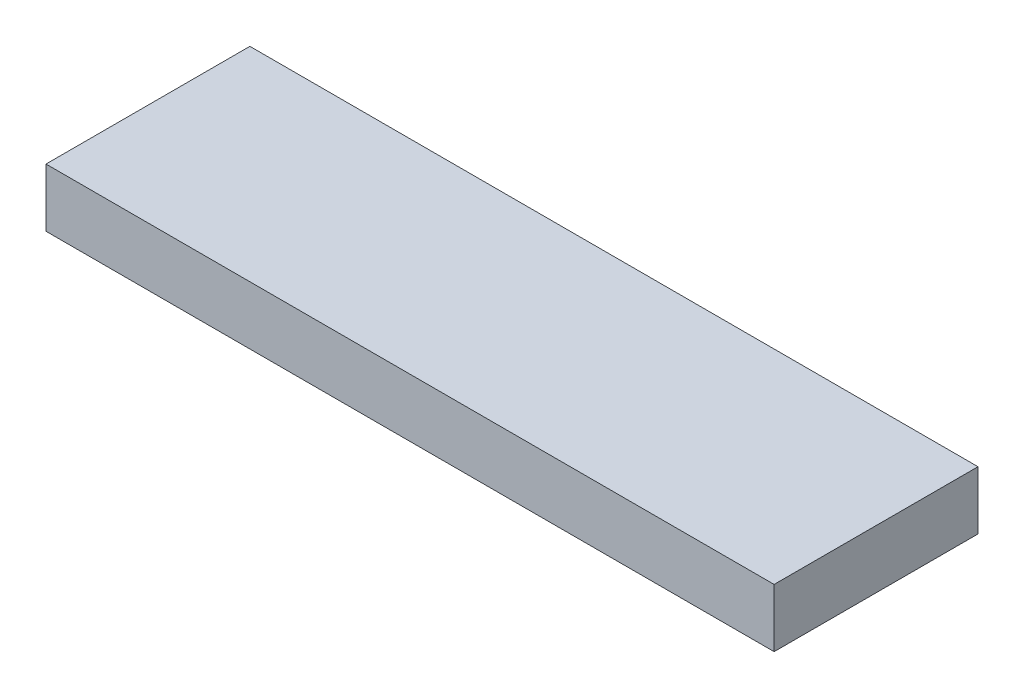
ISO-10303-21;
HEADER;
FILE_DESCRIPTION(('STEP AP214'),'2;1');
FILE_NAME('part.step','',(''),(''),'','','');
FILE_SCHEMA(('AUTOMOTIVE_DESIGN { 1 0 10303 214 1 1 1 1 }'));
ENDSEC;
DATA;
#1=APPLICATION_CONTEXT('core data for automotive mechanical design processes');
#2=APPLICATION_PROTOCOL_DEFINITION('international standard','automotive_design',2000,#1);
#3=PRODUCT_CONTEXT('',#1,'mechanical');
#4=PRODUCT('Part','Part','',(#3));
#5=PRODUCT_RELATED_PRODUCT_CATEGORY('part','',(#4));
#6=PRODUCT_DEFINITION_FORMATION('','',#4);
#7=PRODUCT_DEFINITION_CONTEXT('part definition',#1,'design');
#8=PRODUCT_DEFINITION('design','',#6,#7);
#9=PRODUCT_DEFINITION_SHAPE('','',#8);
#10=(LENGTH_UNIT() NAMED_UNIT(*) SI_UNIT(.MILLI.,.METRE.));
#11=(NAMED_UNIT(*) PLANE_ANGLE_UNIT() SI_UNIT($,.RADIAN.));
#12=(NAMED_UNIT(*) SI_UNIT($,.STERADIAN.) SOLID_ANGLE_UNIT());
#13=UNCERTAINTY_MEASURE_WITH_UNIT(LENGTH_MEASURE(1.E-05),#10,'distance_accuracy_value','');
#14=(GEOMETRIC_REPRESENTATION_CONTEXT(3) GLOBAL_UNCERTAINTY_ASSIGNED_CONTEXT((#13)) GLOBAL_UNIT_ASSIGNED_CONTEXT((#10,
#11,#12)) REPRESENTATION_CONTEXT('',''));
#15=CARTESIAN_POINT('',(0.,0.,0.));
#16=DIRECTION('',(0.,0.,1.));
#17=DIRECTION('',(1.,0.,0.));
#18=AXIS2_PLACEMENT_3D('',#15,#16,#17);
#19=CARTESIAN_POINT('',(0.,0.,35.));
#20=DIRECTION('',(1.,0.,0.));
#21=DIRECTION('',(0.,1.,0.));
#22=AXIS2_PLACEMENT_3D('',#19,#20,#21);
#23=PLANE('',#22);
#24=DIRECTION('',(0.,-1.,0.));
#25=VECTOR('',#24,1.);
#26=CARTESIAN_POINT('',(0.,0.,-35.));
#27=LINE('',#26,#25);
#28=CARTESIAN_POINT('',(0.,0.,-35.));
#29=VERTEX_POINT('',#28);
#30=CARTESIAN_POINT('',(0.,-20.,-35.));
#31=VERTEX_POINT('',#30);
#32=EDGE_CURVE('E70',#29,#31,#27,.T.);
#33=ORIENTED_EDGE('',*,*,#32,.T.);
#34=DIRECTION('',(0.,0.,-1.));
#35=VECTOR('',#34,1.);
#36=CARTESIAN_POINT('',(0.,-20.,35.));
#37=LINE('',#36,#35);
#38=CARTESIAN_POINT('',(0.,-20.,35.));
#39=VERTEX_POINT('',#38);
#40=EDGE_CURVE('E11',#39,#31,#37,.T.);
#41=ORIENTED_EDGE('',*,*,#40,.F.);
#42=DIRECTION('',(0.,-1.,0.));
#43=VECTOR('',#42,1.);
#44=CARTESIAN_POINT('',(0.,0.,35.));
#45=LINE('',#44,#43);
#46=CARTESIAN_POINT('',(0.,0.,35.));
#47=VERTEX_POINT('',#46);
#48=EDGE_CURVE('E88',#47,#39,#45,.T.);
#49=ORIENTED_EDGE('',*,*,#48,.F.);
#50=DIRECTION('',(0.,0.,-1.));
#51=VECTOR('',#50,1.);
#52=CARTESIAN_POINT('',(0.,0.,35.));
#53=LINE('',#52,#51);
#54=EDGE_CURVE('E82',#47,#29,#53,.T.);
#55=ORIENTED_EDGE('',*,*,#54,.T.);
#56=EDGE_LOOP('',(#33,#41,#49,#55));
#57=FACE_BOUND('',#56,.T.);
#58=ADVANCED_FACE('F26',(#57),#23,.F.);
#59=CARTESIAN_POINT('',(0.,-20.,35.));
#60=DIRECTION('',(0.,1.,0.));
#61=DIRECTION('',(0.,0.,1.));
#62=AXIS2_PLACEMENT_3D('',#59,#60,#61);
#63=PLANE('',#62);
#64=DIRECTION('',(1.,0.,0.));
#65=VECTOR('',#64,1.);
#66=CARTESIAN_POINT('',(0.,-20.,-35.));
#67=LINE('',#66,#65);
#68=CARTESIAN_POINT('',(250.,-20.,-35.));
#69=VERTEX_POINT('',#68);
#70=EDGE_CURVE('E66',#31,#69,#67,.T.);
#71=ORIENTED_EDGE('',*,*,#70,.T.);
#72=DIRECTION('',(0.,0.,-1.));
#73=VECTOR('',#72,1.);
#74=CARTESIAN_POINT('',(250.,-20.,35.));
#75=LINE('',#74,#73);
#76=CARTESIAN_POINT('',(250.,-20.,35.));
#77=VERTEX_POINT('',#76);
#78=EDGE_CURVE('E33',#77,#69,#75,.T.);
#79=ORIENTED_EDGE('',*,*,#78,.F.);
#80=DIRECTION('',(1.,0.,0.));
#81=VECTOR('',#80,1.);
#82=CARTESIAN_POINT('',(0.,-20.,35.));
#83=LINE('',#82,#81);
#84=EDGE_CURVE('E78',#39,#77,#83,.T.);
#85=ORIENTED_EDGE('',*,*,#84,.F.);
#86=ORIENTED_EDGE('',*,*,#40,.T.);
#87=EDGE_LOOP('',(#71,#79,#85,#86));
#88=FACE_BOUND('',#87,.T.);
#89=ADVANCED_FACE('F77',(#88),#63,.F.);
#90=CARTESIAN_POINT('',(250.,0.,35.));
#91=DIRECTION('',(-1.,0.,0.));
#92=DIRECTION('',(0.,0.,1.));
#93=AXIS2_PLACEMENT_3D('',#90,#91,#92);
#94=PLANE('',#93);
#95=DIRECTION('',(0.,1.,0.));
#96=VECTOR('',#95,1.);
#97=CARTESIAN_POINT('',(250.,0.,-35.));
#98=LINE('',#97,#96);
#99=CARTESIAN_POINT('',(250.,0.,-35.));
#100=VERTEX_POINT('',#99);
#101=EDGE_CURVE('E71',#69,#100,#98,.T.);
#102=ORIENTED_EDGE('',*,*,#101,.T.);
#103=DIRECTION('',(0.,0.,-1.));
#104=VECTOR('',#103,1.);
#105=CARTESIAN_POINT('',(250.,0.,35.));
#106=LINE('',#105,#104);
#107=CARTESIAN_POINT('',(250.,0.,35.));
#108=VERTEX_POINT('',#107);
#109=EDGE_CURVE('E94',#108,#100,#106,.T.);
#110=ORIENTED_EDGE('',*,*,#109,.F.);
#111=DIRECTION('',(0.,1.,0.));
#112=VECTOR('',#111,1.);
#113=CARTESIAN_POINT('',(250.,0.,35.));
#114=LINE('',#113,#112);
#115=EDGE_CURVE('E45',#77,#108,#114,.T.);
#116=ORIENTED_EDGE('',*,*,#115,.F.);
#117=ORIENTED_EDGE('',*,*,#78,.T.);
#118=EDGE_LOOP('',(#102,#110,#116,#117));
#119=FACE_BOUND('',#118,.T.);
#120=ADVANCED_FACE('F97',(#119),#94,.F.);
#121=CARTESIAN_POINT('',(0.,0.,35.));
#122=DIRECTION('',(0.,-1.,0.));
#123=DIRECTION('',(0.,0.,-1.));
#124=AXIS2_PLACEMENT_3D('',#121,#122,#123);
#125=PLANE('',#124);
#126=DIRECTION('',(-1.,0.,0.));
#127=VECTOR('',#126,1.);
#128=CARTESIAN_POINT('',(0.,0.,-35.));
#129=LINE('',#128,#127);
#130=EDGE_CURVE('E86',#100,#29,#129,.T.);
#131=ORIENTED_EDGE('',*,*,#130,.T.);
#132=ORIENTED_EDGE('',*,*,#54,.F.);
#133=DIRECTION('',(-1.,0.,0.));
#134=VECTOR('',#133,1.);
#135=CARTESIAN_POINT('',(0.,0.,35.));
#136=LINE('',#135,#134);
#137=EDGE_CURVE('E40',#108,#47,#136,.T.);
#138=ORIENTED_EDGE('',*,*,#137,.F.);
#139=ORIENTED_EDGE('',*,*,#109,.T.);
#140=EDGE_LOOP('',(#131,#132,#138,#139));
#141=FACE_BOUND('',#140,.T.);
#142=ADVANCED_FACE('F99',(#141),#125,.F.);
#143=CARTESIAN_POINT('',(0.,-20.,35.));
#144=DIRECTION('',(0.,0.,1.));
#145=DIRECTION('',(1.,0.,0.));
#146=AXIS2_PLACEMENT_3D('',#143,#144,#145);
#147=PLANE('',#146);
#148=ORIENTED_EDGE('',*,*,#48,.T.);
#149=ORIENTED_EDGE('',*,*,#84,.T.);
#150=ORIENTED_EDGE('',*,*,#115,.T.);
#151=ORIENTED_EDGE('',*,*,#137,.T.);
#152=EDGE_LOOP('',(#148,#149,#150,#151));
#153=FACE_BOUND('',#152,.T.);
#154=ADVANCED_FACE('F100',(#153),#147,.T.);
#155=CARTESIAN_POINT('',(0.,-20.,-35.));
#156=DIRECTION('',(0.,0.,1.));
#157=DIRECTION('',(1.,0.,0.));
#158=AXIS2_PLACEMENT_3D('',#155,#156,#157);
#159=PLANE('',#158);
#160=ORIENTED_EDGE('',*,*,#32,.F.);
#161=ORIENTED_EDGE('',*,*,#130,.F.);
#162=ORIENTED_EDGE('',*,*,#101,.F.);
#163=ORIENTED_EDGE('',*,*,#70,.F.);
#164=EDGE_LOOP('',(#160,#161,#162,#163));
#165=FACE_BOUND('',#164,.T.);
#166=ADVANCED_FACE('F67',(#165),#159,.F.);
#167=CLOSED_SHELL('',(#58,#89,#120,#142,#154,#166));
#168=MANIFOLD_SOLID_BREP('B2',#167);
#169=ADVANCED_BREP_SHAPE_REPRESENTATION('',(#18,#168),#14);
#170=SHAPE_DEFINITION_REPRESENTATION(#9,#169);
ENDSEC;
END-ISO-10303-21;
